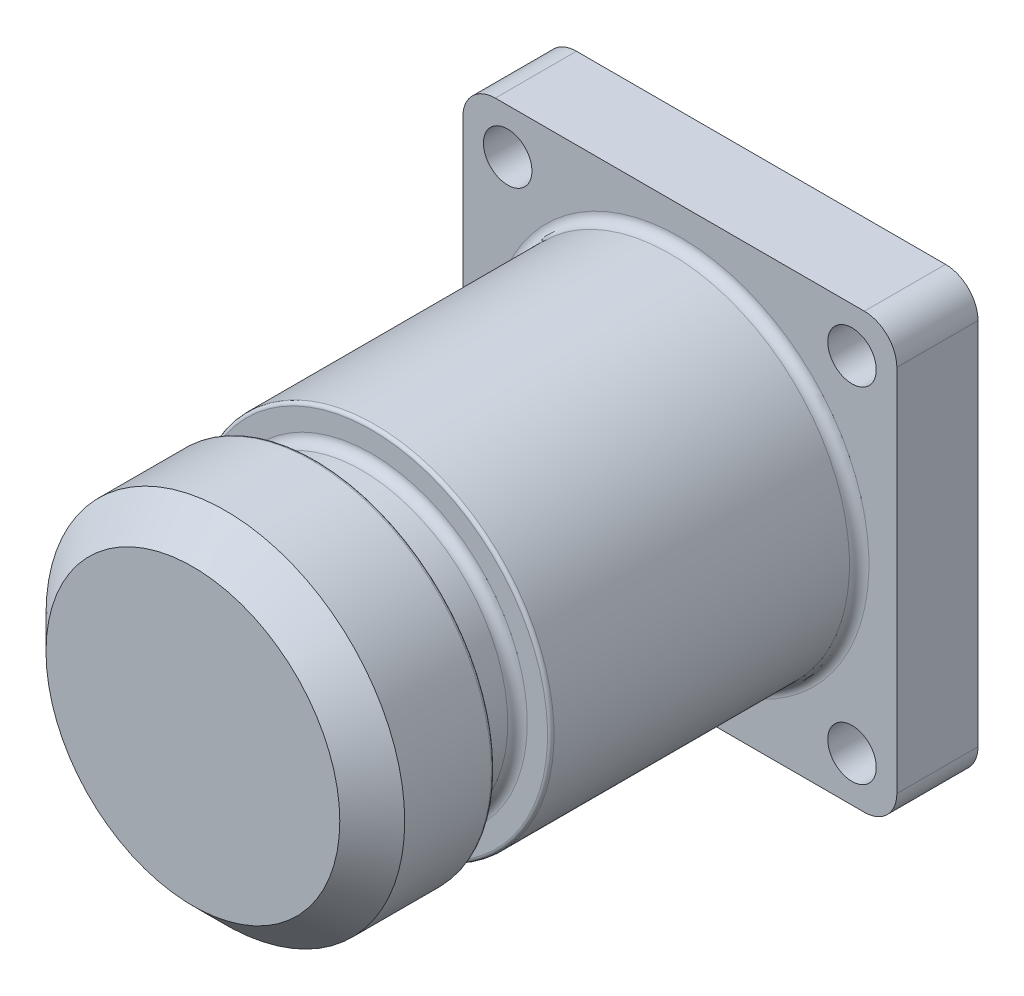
ISO-10303-21;
HEADER;
FILE_DESCRIPTION(('STEP AP214'),'2;1');
FILE_NAME('part.step','',(''),(''),'','','');
FILE_SCHEMA(('AUTOMOTIVE_DESIGN { 1 0 10303 214 1 1 1 1 }'));
ENDSEC;
DATA;
#1=APPLICATION_CONTEXT('core data for automotive mechanical design processes');
#2=APPLICATION_PROTOCOL_DEFINITION('international standard','automotive_design',2000,#1);
#3=PRODUCT_CONTEXT('',#1,'mechanical');
#4=PRODUCT('Part','Part','',(#3));
#5=PRODUCT_RELATED_PRODUCT_CATEGORY('part','',(#4));
#6=PRODUCT_DEFINITION_FORMATION('','',#4);
#7=PRODUCT_DEFINITION_CONTEXT('part definition',#1,'design');
#8=PRODUCT_DEFINITION('design','',#6,#7);
#9=PRODUCT_DEFINITION_SHAPE('','',#8);
#10=(LENGTH_UNIT() NAMED_UNIT(*) SI_UNIT(.MILLI.,.METRE.));
#11=(NAMED_UNIT(*) PLANE_ANGLE_UNIT() SI_UNIT($,.RADIAN.));
#12=(NAMED_UNIT(*) SI_UNIT($,.STERADIAN.) SOLID_ANGLE_UNIT());
#13=UNCERTAINTY_MEASURE_WITH_UNIT(LENGTH_MEASURE(1.E-05),#10,'distance_accuracy_value','');
#14=(GEOMETRIC_REPRESENTATION_CONTEXT(3) GLOBAL_UNCERTAINTY_ASSIGNED_CONTEXT((#13)) GLOBAL_UNIT_ASSIGNED_CONTEXT((#10,
#11,#12)) REPRESENTATION_CONTEXT('',''));
#15=CARTESIAN_POINT('',(0.,0.,0.));
#16=DIRECTION('',(0.,0.,1.));
#17=DIRECTION('',(1.,0.,0.));
#18=AXIS2_PLACEMENT_3D('',#15,#16,#17);
#19=CARTESIAN_POINT('',(0.,14.0335,38.1));
#20=DIRECTION('',(0.,0.,-1.));
#21=DIRECTION('',(-1.,0.,0.));
#22=AXIS2_PLACEMENT_3D('',#19,#20,#21);
#23=PLANE('',#22);
#24=CARTESIAN_POINT('',(0.,0.,38.1));
#25=DIRECTION('',(0.,0.,-1.));
#26=DIRECTION('',(-1.,0.,0.));
#27=AXIS2_PLACEMENT_3D('',#24,#25,#26);
#28=CIRCLE('',#27,11.4935);
#29=CARTESIAN_POINT('',(-11.4935,0.,38.1));
#30=VERTEX_POINT('',#29);
#31=EDGE_CURVE('E189',#30,#30,#28,.F.);
#32=ORIENTED_EDGE('',*,*,#31,.T.);
#33=EDGE_LOOP('',(#32));
#34=FACE_BOUND('',#33,.T.);
#35=ADVANCED_FACE('F45',(#34),#23,.F.);
#36=CARTESIAN_POINT('',(0.,14.0335,0.));
#37=DIRECTION('',(0.,0.,-1.));
#38=DIRECTION('',(-1.,0.,0.));
#39=AXIS2_PLACEMENT_3D('',#36,#37,#38);
#40=PLANE('',#39);
#41=CARTESIAN_POINT('',(0.,0.,0.));
#42=DIRECTION('',(0.,0.,-1.));
#43=DIRECTION('',(-1.,0.,0.));
#44=AXIS2_PLACEMENT_3D('',#41,#42,#43);
#45=CIRCLE('',#44,14.7955);
#46=CARTESIAN_POINT('',(-14.7955,0.,0.));
#47=VERTEX_POINT('',#46);
#48=EDGE_CURVE('E11',#47,#47,#45,.T.);
#49=ORIENTED_EDGE('',*,*,#48,.T.);
#50=EDGE_LOOP('',(#49));
#51=FACE_BOUND('',#50,.T.);
#52=CARTESIAN_POINT('',(13.4703841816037,13.4703841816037,0.));
#53=DIRECTION('',(0.,0.,-1.));
#54=DIRECTION('',(-1.,0.,0.));
#55=AXIS2_PLACEMENT_3D('',#52,#53,#54);
#56=CIRCLE('',#55,1.89864999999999);
#57=CARTESIAN_POINT('',(11.5717341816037,13.4703841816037,0.));
#58=VERTEX_POINT('',#57);
#59=EDGE_CURVE('E544',#58,#58,#56,.T.);
#60=ORIENTED_EDGE('',*,*,#59,.T.);
#61=EDGE_LOOP('',(#60));
#62=FACE_BOUND('',#61,.T.);
#63=CARTESIAN_POINT('',(-13.4703841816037,13.4703841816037,0.));
#64=DIRECTION('',(0.,0.,-1.));
#65=DIRECTION('',(-1.,0.,0.));
#66=AXIS2_PLACEMENT_3D('',#63,#64,#65);
#67=CIRCLE('',#66,1.89864999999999);
#68=CARTESIAN_POINT('',(-15.3690341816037,13.4703841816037,0.));
#69=VERTEX_POINT('',#68);
#70=EDGE_CURVE('E536',#69,#69,#67,.T.);
#71=ORIENTED_EDGE('',*,*,#70,.T.);
#72=EDGE_LOOP('',(#71));
#73=FACE_BOUND('',#72,.T.);
#74=CARTESIAN_POINT('',(-13.4703841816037,-13.4703841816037,0.));
#75=DIRECTION('',(0.,0.,-1.));
#76=DIRECTION('',(-1.,0.,0.));
#77=AXIS2_PLACEMENT_3D('',#74,#75,#76);
#78=CIRCLE('',#77,1.89864999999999);
#79=CARTESIAN_POINT('',(-15.3690341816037,-13.4703841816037,0.));
#80=VERTEX_POINT('',#79);
#81=EDGE_CURVE('E150',#80,#80,#78,.T.);
#82=ORIENTED_EDGE('',*,*,#81,.T.);
#83=EDGE_LOOP('',(#82));
#84=FACE_BOUND('',#83,.T.);
#85=CARTESIAN_POINT('',(13.4703841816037,-13.4703841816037,0.));
#86=DIRECTION('',(0.,0.,-1.));
#87=DIRECTION('',(-1.,0.,0.));
#88=AXIS2_PLACEMENT_3D('',#85,#86,#87);
#89=CIRCLE('',#88,1.89864999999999);
#90=CARTESIAN_POINT('',(11.5717341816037,-13.4703841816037,0.));
#91=VERTEX_POINT('',#90);
#92=EDGE_CURVE('E515',#91,#91,#89,.T.);
#93=ORIENTED_EDGE('',*,*,#92,.T.);
#94=EDGE_LOOP('',(#93));
#95=FACE_BOUND('',#94,.T.);
#96=DIRECTION('',(-1.,0.,0.));
#97=VECTOR('',#96,1.);
#98=CARTESIAN_POINT('',(-16.9785031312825,16.9785031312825,0.));
#99=LINE('',#98,#97);
#100=CARTESIAN_POINT('',(14.4385031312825,16.9785031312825,0.));
#101=VERTEX_POINT('',#100);
#102=CARTESIAN_POINT('',(-14.4385031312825,16.9785031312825,0.));
#103=VERTEX_POINT('',#102);
#104=EDGE_CURVE('E116',#101,#103,#99,.T.);
#105=ORIENTED_EDGE('',*,*,#104,.T.);
#106=CARTESIAN_POINT('',(-14.4385031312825,14.4385031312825,0.));
#107=DIRECTION('',(0.,0.,-1.));
#108=DIRECTION('',(-1.,0.,0.));
#109=AXIS2_PLACEMENT_3D('',#106,#107,#108);
#110=CIRCLE('',#109,2.54);
#111=CARTESIAN_POINT('',(-16.9785031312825,14.4385031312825,0.));
#112=VERTEX_POINT('',#111);
#113=EDGE_CURVE('E157',#103,#112,#110,.F.);
#114=ORIENTED_EDGE('',*,*,#113,.T.);
#115=DIRECTION('',(0.,-1.,0.));
#116=VECTOR('',#115,1.);
#117=CARTESIAN_POINT('',(-16.9785031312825,16.9785031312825,0.));
#118=LINE('',#117,#116);
#119=CARTESIAN_POINT('',(-16.9785031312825,-14.4385031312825,0.));
#120=VERTEX_POINT('',#119);
#121=EDGE_CURVE('E511',#112,#120,#118,.T.);
#122=ORIENTED_EDGE('',*,*,#121,.T.);
#123=CARTESIAN_POINT('',(-14.4385031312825,-14.4385031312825,0.));
#124=DIRECTION('',(0.,0.,-1.));
#125=DIRECTION('',(-1.,0.,0.));
#126=AXIS2_PLACEMENT_3D('',#123,#124,#125);
#127=CIRCLE('',#126,2.54);
#128=CARTESIAN_POINT('',(-14.4385031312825,-16.9785031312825,0.));
#129=VERTEX_POINT('',#128);
#130=EDGE_CURVE('E154',#120,#129,#127,.F.);
#131=ORIENTED_EDGE('',*,*,#130,.T.);
#132=DIRECTION('',(1.,0.,0.));
#133=VECTOR('',#132,1.);
#134=CARTESIAN_POINT('',(-16.9785031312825,-16.9785031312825,0.));
#135=LINE('',#134,#133);
#136=CARTESIAN_POINT('',(14.4385031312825,-16.9785031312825,0.));
#137=VERTEX_POINT('',#136);
#138=EDGE_CURVE('E504',#129,#137,#135,.T.);
#139=ORIENTED_EDGE('',*,*,#138,.T.);
#140=CARTESIAN_POINT('',(14.4385031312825,-14.4385031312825,0.));
#141=DIRECTION('',(0.,0.,-1.));
#142=DIRECTION('',(-1.,0.,0.));
#143=AXIS2_PLACEMENT_3D('',#140,#141,#142);
#144=CIRCLE('',#143,2.54);
#145=CARTESIAN_POINT('',(16.9785031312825,-14.4385031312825,0.));
#146=VERTEX_POINT('',#145);
#147=EDGE_CURVE('E124',#137,#146,#144,.F.);
#148=ORIENTED_EDGE('',*,*,#147,.T.);
#149=DIRECTION('',(0.,1.,0.));
#150=VECTOR('',#149,1.);
#151=CARTESIAN_POINT('',(16.9785031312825,16.9785031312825,0.));
#152=LINE('',#151,#150);
#153=CARTESIAN_POINT('',(16.9785031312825,14.4385031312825,0.));
#154=VERTEX_POINT('',#153);
#155=EDGE_CURVE('E118',#146,#154,#152,.T.);
#156=ORIENTED_EDGE('',*,*,#155,.T.);
#157=CARTESIAN_POINT('',(14.4385031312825,14.4385031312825,0.));
#158=DIRECTION('',(0.,0.,-1.));
#159=DIRECTION('',(-1.,0.,0.));
#160=AXIS2_PLACEMENT_3D('',#157,#158,#159);
#161=CIRCLE('',#160,2.54);
#162=EDGE_CURVE('E113',#154,#101,#161,.F.);
#163=ORIENTED_EDGE('',*,*,#162,.T.);
#164=EDGE_LOOP('',(#105,#114,#122,#131,#139,#148,#156,#163));
#165=FACE_BOUND('',#164,.T.);
#166=ADVANCED_FACE('F115',(#51,#62,#73,#84,#95,#165),#40,.F.);
#167=CARTESIAN_POINT('',(0.,0.,0.145825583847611));
#168=DIRECTION('',(0.,0.,1.));
#169=DIRECTION('',(1.,0.,0.));
#170=AXIS2_PLACEMENT_3D('',#167,#168,#169);
#171=CYLINDRICAL_SURFACE('',#170,14.0335);
#172=CARTESIAN_POINT('',(0.,0.,0.762));
#173=DIRECTION('',(0.,0.,-1.));
#174=DIRECTION('',(-1.,0.,0.));
#175=AXIS2_PLACEMENT_3D('',#172,#173,#174);
#176=CIRCLE('',#175,14.0335);
#177=CARTESIAN_POINT('',(-14.0335,0.,0.762));
#178=VERTEX_POINT('',#177);
#179=EDGE_CURVE('E54',#178,#178,#176,.F.);
#180=ORIENTED_EDGE('',*,*,#179,.T.);
#181=EDGE_LOOP('',(#180));
#182=FACE_BOUND('',#181,.T.);
#183=CARTESIAN_POINT('',(0.,0.,23.876));
#184=DIRECTION('',(0.,0.,-1.));
#185=DIRECTION('',(-1.,0.,0.));
#186=AXIS2_PLACEMENT_3D('',#183,#184,#185);
#187=CIRCLE('',#186,14.0335);
#188=CARTESIAN_POINT('',(-14.0335,0.,23.876));
#189=VERTEX_POINT('',#188);
#190=EDGE_CURVE('E225',#189,#189,#187,.T.);
#191=ORIENTED_EDGE('',*,*,#190,.T.);
#192=EDGE_LOOP('',(#191));
#193=FACE_BOUND('',#192,.T.);
#194=ADVANCED_FACE('F233',(#182,#193),#171,.T.);
#195=CARTESIAN_POINT('',(0.,14.0335,24.13));
#196=DIRECTION('',(0.,0.,-1.));
#197=DIRECTION('',(-1.,0.,0.));
#198=AXIS2_PLACEMENT_3D('',#195,#196,#197);
#199=PLANE('',#198);
#200=CARTESIAN_POINT('',(0.,0.,24.13));
#201=DIRECTION('',(0.,0.,-1.));
#202=DIRECTION('',(-1.,0.,0.));
#203=AXIS2_PLACEMENT_3D('',#200,#201,#202);
#204=CIRCLE('',#203,13.7795);
#205=CARTESIAN_POINT('',(-13.7795,0.,24.13));
#206=VERTEX_POINT('',#205);
#207=EDGE_CURVE('E221',#206,#206,#204,.F.);
#208=ORIENTED_EDGE('',*,*,#207,.T.);
#209=EDGE_LOOP('',(#208));
#210=FACE_BOUND('',#209,.T.);
#211=CARTESIAN_POINT('',(0.,0.,24.13));
#212=DIRECTION('',(0.,0.,-1.));
#213=DIRECTION('',(-1.,0.,0.));
#214=AXIS2_PLACEMENT_3D('',#211,#212,#213);
#215=CIRCLE('',#214,12.192);
#216=CARTESIAN_POINT('',(-12.192,0.,24.13));
#217=VERTEX_POINT('',#216);
#218=EDGE_CURVE('E209',#217,#217,#215,.T.);
#219=ORIENTED_EDGE('',*,*,#218,.T.);
#220=EDGE_LOOP('',(#219));
#221=FACE_BOUND('',#220,.T.);
#222=ADVANCED_FACE('F317',(#210,#221),#199,.F.);
#223=CARTESIAN_POINT('',(0.,0.,0.145825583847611));
#224=DIRECTION('',(0.,0.,1.));
#225=DIRECTION('',(1.,0.,0.));
#226=AXIS2_PLACEMENT_3D('',#223,#224,#225);
#227=CYLINDRICAL_SURFACE('',#226,11.43);
#228=CARTESIAN_POINT('',(0.,0.,27.7622));
#229=DIRECTION('',(0.,0.,1.));
#230=DIRECTION('',(1.,0.,0.));
#231=AXIS2_PLACEMENT_3D('',#228,#229,#230);
#232=CIRCLE('',#231,11.43);
#233=CARTESIAN_POINT('',(11.43,0.,27.7622));
#234=VERTEX_POINT('',#233);
#235=EDGE_CURVE('E205',#234,#234,#232,.F.);
#236=ORIENTED_EDGE('',*,*,#235,.T.);
#237=EDGE_LOOP('',(#236));
#238=FACE_BOUND('',#237,.T.);
#239=CARTESIAN_POINT('',(0.,0.,24.892));
#240=DIRECTION('',(0.,0.,-1.));
#241=DIRECTION('',(-1.,0.,0.));
#242=AXIS2_PLACEMENT_3D('',#239,#240,#241);
#243=CIRCLE('',#242,11.43);
#244=CARTESIAN_POINT('',(-11.43,0.,24.892));
#245=VERTEX_POINT('',#244);
#246=EDGE_CURVE('E201',#245,#245,#243,.F.);
#247=ORIENTED_EDGE('',*,*,#246,.T.);
#248=EDGE_LOOP('',(#247));
#249=FACE_BOUND('',#248,.T.);
#250=ADVANCED_FACE('F310',(#238,#249),#227,.T.);
#251=CARTESIAN_POINT('',(0.,14.0335,28.5242));
#252=DIRECTION('',(0.,0.,1.));
#253=DIRECTION('',(1.,0.,0.));
#254=AXIS2_PLACEMENT_3D('',#251,#252,#253);
#255=PLANE('',#254);
#256=CARTESIAN_POINT('',(0.,0.,28.5242));
#257=DIRECTION('',(0.,0.,1.));
#258=DIRECTION('',(1.,0.,0.));
#259=AXIS2_PLACEMENT_3D('',#256,#257,#258);
#260=CIRCLE('',#259,13.7795);
#261=CARTESIAN_POINT('',(13.7795,0.,28.5242));
#262=VERTEX_POINT('',#261);
#263=EDGE_CURVE('E217',#262,#262,#260,.F.);
#264=ORIENTED_EDGE('',*,*,#263,.T.);
#265=EDGE_LOOP('',(#264));
#266=FACE_BOUND('',#265,.T.);
#267=CARTESIAN_POINT('',(0.,0.,28.5242));
#268=DIRECTION('',(0.,0.,1.));
#269=DIRECTION('',(1.,0.,0.));
#270=AXIS2_PLACEMENT_3D('',#267,#268,#269);
#271=CIRCLE('',#270,12.192);
#272=CARTESIAN_POINT('',(12.192,0.,28.5242));
#273=VERTEX_POINT('',#272);
#274=EDGE_CURVE('E197',#273,#273,#271,.T.);
#275=ORIENTED_EDGE('',*,*,#274,.T.);
#276=EDGE_LOOP('',(#275));
#277=FACE_BOUND('',#276,.T.);
#278=ADVANCED_FACE('F299',(#266,#277),#255,.F.);
#279=CARTESIAN_POINT('',(0.,0.,0.145825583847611));
#280=DIRECTION('',(0.,0.,1.));
#281=DIRECTION('',(1.,0.,0.));
#282=AXIS2_PLACEMENT_3D('',#279,#280,#281);
#283=CYLINDRICAL_SURFACE('',#282,14.0335);
#284=CARTESIAN_POINT('',(0.,0.,28.7782));
#285=DIRECTION('',(0.,0.,1.));
#286=DIRECTION('',(1.,0.,0.));
#287=AXIS2_PLACEMENT_3D('',#284,#285,#286);
#288=CIRCLE('',#287,14.0335);
#289=CARTESIAN_POINT('',(14.0335,0.,28.7782));
#290=VERTEX_POINT('',#289);
#291=EDGE_CURVE('E213',#290,#290,#288,.T.);
#292=ORIENTED_EDGE('',*,*,#291,.T.);
#293=EDGE_LOOP('',(#292));
#294=FACE_BOUND('',#293,.T.);
#295=CARTESIAN_POINT('',(0.,0.,35.56));
#296=DIRECTION('',(0.,0.,-1.));
#297=DIRECTION('',(-1.,0.,0.));
#298=AXIS2_PLACEMENT_3D('',#295,#296,#297);
#299=CIRCLE('',#298,14.0335);
#300=CARTESIAN_POINT('',(-14.0335,0.,35.56));
#301=VERTEX_POINT('',#300);
#302=EDGE_CURVE('E193',#301,#301,#299,.T.);
#303=ORIENTED_EDGE('',*,*,#302,.T.);
#304=EDGE_LOOP('',(#303));
#305=FACE_BOUND('',#304,.T.);
#306=ADVANCED_FACE('F296',(#294,#305),#283,.T.);
#307=CARTESIAN_POINT('',(-16.9785031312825,16.9785031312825,-6.35));
#308=DIRECTION('',(-1.,0.,0.));
#309=DIRECTION('',(0.,0.,1.));
#310=AXIS2_PLACEMENT_3D('',#307,#308,#309);
#311=PLANE('',#310);
#312=ORIENTED_EDGE('',*,*,#121,.F.);
#313=DIRECTION('',(0.,0.,1.));
#314=VECTOR('',#313,1.);
#315=CARTESIAN_POINT('',(-16.9785031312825,14.4385031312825,-6.35));
#316=LINE('',#315,#314);
#317=CARTESIAN_POINT('',(-16.9785031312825,14.4385031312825,-6.35));
#318=VERTEX_POINT('',#317);
#319=EDGE_CURVE('E164',#112,#318,#316,.F.);
#320=ORIENTED_EDGE('',*,*,#319,.T.);
#321=DIRECTION('',(0.,-1.,0.));
#322=VECTOR('',#321,1.);
#323=CARTESIAN_POINT('',(-16.9785031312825,16.9785031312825,-6.35));
#324=LINE('',#323,#322);
#325=CARTESIAN_POINT('',(-16.9785031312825,-14.4385031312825,-6.35));
#326=VERTEX_POINT('',#325);
#327=EDGE_CURVE('E135',#318,#326,#324,.T.);
#328=ORIENTED_EDGE('',*,*,#327,.T.);
#329=DIRECTION('',(0.,0.,1.));
#330=VECTOR('',#329,1.);
#331=CARTESIAN_POINT('',(-16.9785031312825,-14.4385031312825,-6.35));
#332=LINE('',#331,#330);
#333=EDGE_CURVE('E160',#326,#120,#332,.T.);
#334=ORIENTED_EDGE('',*,*,#333,.T.);
#335=EDGE_LOOP('',(#312,#320,#328,#334));
#336=FACE_BOUND('',#335,.T.);
#337=ADVANCED_FACE('F298',(#336),#311,.T.);
#338=CARTESIAN_POINT('',(-16.9785031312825,16.9785031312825,-6.35));
#339=DIRECTION('',(0.,1.,0.));
#340=DIRECTION('',(0.,0.,1.));
#341=AXIS2_PLACEMENT_3D('',#338,#339,#340);
#342=PLANE('',#341);
#343=DIRECTION('',(-1.,0.,0.));
#344=VECTOR('',#343,1.);
#345=CARTESIAN_POINT('',(-16.9785031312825,16.9785031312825,-6.35));
#346=LINE('',#345,#344);
#347=CARTESIAN_POINT('',(14.4385031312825,16.9785031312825,-6.35));
#348=VERTEX_POINT('',#347);
#349=CARTESIAN_POINT('',(-14.4385031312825,16.9785031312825,-6.35));
#350=VERTEX_POINT('',#349);
#351=EDGE_CURVE('E141',#348,#350,#346,.T.);
#352=ORIENTED_EDGE('',*,*,#351,.T.);
#353=DIRECTION('',(0.,0.,1.));
#354=VECTOR('',#353,1.);
#355=CARTESIAN_POINT('',(-14.4385031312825,16.9785031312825,-6.35));
#356=LINE('',#355,#354);
#357=EDGE_CURVE('E125',#350,#103,#356,.T.);
#358=ORIENTED_EDGE('',*,*,#357,.T.);
#359=ORIENTED_EDGE('',*,*,#104,.F.);
#360=DIRECTION('',(0.,0.,1.));
#361=VECTOR('',#360,1.);
#362=CARTESIAN_POINT('',(14.4385031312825,16.9785031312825,-6.35));
#363=LINE('',#362,#361);
#364=EDGE_CURVE('E131',#101,#348,#363,.F.);
#365=ORIENTED_EDGE('',*,*,#364,.T.);
#366=EDGE_LOOP('',(#352,#358,#359,#365));
#367=FACE_BOUND('',#366,.T.);
#368=ADVANCED_FACE('F130',(#367),#342,.T.);
#369=CARTESIAN_POINT('',(16.9785031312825,16.9785031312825,-6.35));
#370=DIRECTION('',(1.,0.,0.));
#371=DIRECTION('',(0.,0.,-1.));
#372=AXIS2_PLACEMENT_3D('',#369,#370,#371);
#373=PLANE('',#372);
#374=ORIENTED_EDGE('',*,*,#155,.F.);
#375=DIRECTION('',(0.,0.,1.));
#376=VECTOR('',#375,1.);
#377=CARTESIAN_POINT('',(16.9785031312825,-14.4385031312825,-6.35));
#378=LINE('',#377,#376);
#379=CARTESIAN_POINT('',(16.9785031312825,-14.4385031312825,-6.35));
#380=VERTEX_POINT('',#379);
#381=EDGE_CURVE('E186',#146,#380,#378,.F.);
#382=ORIENTED_EDGE('',*,*,#381,.T.);
#383=DIRECTION('',(0.,1.,0.));
#384=VECTOR('',#383,1.);
#385=CARTESIAN_POINT('',(16.9785031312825,16.9785031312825,-6.35));
#386=LINE('',#385,#384);
#387=CARTESIAN_POINT('',(16.9785031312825,14.4385031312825,-6.35));
#388=VERTEX_POINT('',#387);
#389=EDGE_CURVE('E147',#380,#388,#386,.T.);
#390=ORIENTED_EDGE('',*,*,#389,.T.);
#391=DIRECTION('',(0.,0.,1.));
#392=VECTOR('',#391,1.);
#393=CARTESIAN_POINT('',(16.9785031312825,14.4385031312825,-6.35));
#394=LINE('',#393,#392);
#395=EDGE_CURVE('E183',#388,#154,#394,.T.);
#396=ORIENTED_EDGE('',*,*,#395,.T.);
#397=EDGE_LOOP('',(#374,#382,#390,#396));
#398=FACE_BOUND('',#397,.T.);
#399=ADVANCED_FACE('F446',(#398),#373,.T.);
#400=CARTESIAN_POINT('',(-16.9785031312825,-16.9785031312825,-6.35));
#401=DIRECTION('',(0.,-1.,0.));
#402=DIRECTION('',(0.,0.,-1.));
#403=AXIS2_PLACEMENT_3D('',#400,#401,#402);
#404=PLANE('',#403);
#405=ORIENTED_EDGE('',*,*,#138,.F.);
#406=DIRECTION('',(0.,0.,1.));
#407=VECTOR('',#406,1.);
#408=CARTESIAN_POINT('',(-14.4385031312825,-16.9785031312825,-6.35));
#409=LINE('',#408,#407);
#410=CARTESIAN_POINT('',(-14.4385031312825,-16.9785031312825,-6.35));
#411=VERTEX_POINT('',#410);
#412=EDGE_CURVE('E68',#129,#411,#409,.F.);
#413=ORIENTED_EDGE('',*,*,#412,.T.);
#414=DIRECTION('',(1.,0.,0.));
#415=VECTOR('',#414,1.);
#416=CARTESIAN_POINT('',(-16.9785031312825,-16.9785031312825,-6.35));
#417=LINE('',#416,#415);
#418=CARTESIAN_POINT('',(14.4385031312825,-16.9785031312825,-6.35));
#419=VERTEX_POINT('',#418);
#420=EDGE_CURVE('E508',#411,#419,#417,.T.);
#421=ORIENTED_EDGE('',*,*,#420,.T.);
#422=DIRECTION('',(0.,0.,1.));
#423=VECTOR('',#422,1.);
#424=CARTESIAN_POINT('',(14.4385031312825,-16.9785031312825,-6.35));
#425=LINE('',#424,#423);
#426=EDGE_CURVE('E177',#419,#137,#425,.T.);
#427=ORIENTED_EDGE('',*,*,#426,.T.);
#428=EDGE_LOOP('',(#405,#413,#421,#427));
#429=FACE_BOUND('',#428,.T.);
#430=ADVANCED_FACE('F436',(#429),#404,.T.);
#431=CARTESIAN_POINT('',(0.,16.9785031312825,-6.35));
#432=DIRECTION('',(0.,0.,1.));
#433=DIRECTION('',(1.,0.,0.));
#434=AXIS2_PLACEMENT_3D('',#431,#432,#433);
#435=PLANE('',#434);
#436=CARTESIAN_POINT('',(13.4703841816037,13.4703841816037,-6.35));
#437=DIRECTION('',(0.,0.,-1.));
#438=DIRECTION('',(-1.,0.,0.));
#439=AXIS2_PLACEMENT_3D('',#436,#437,#438);
#440=CIRCLE('',#439,1.89864999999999);
#441=CARTESIAN_POINT('',(11.5717341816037,13.4703841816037,-6.35));
#442=VERTEX_POINT('',#441);
#443=EDGE_CURVE('E548',#442,#442,#440,.T.);
#444=ORIENTED_EDGE('',*,*,#443,.F.);
#445=EDGE_LOOP('',(#444));
#446=FACE_BOUND('',#445,.T.);
#447=CARTESIAN_POINT('',(-13.4703841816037,13.4703841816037,-6.35));
#448=DIRECTION('',(0.,0.,-1.));
#449=DIRECTION('',(-1.,0.,0.));
#450=AXIS2_PLACEMENT_3D('',#447,#448,#449);
#451=CIRCLE('',#450,1.89864999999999);
#452=CARTESIAN_POINT('',(-15.3690341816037,13.4703841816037,-6.35));
#453=VERTEX_POINT('',#452);
#454=EDGE_CURVE('E540',#453,#453,#451,.T.);
#455=ORIENTED_EDGE('',*,*,#454,.F.);
#456=EDGE_LOOP('',(#455));
#457=FACE_BOUND('',#456,.T.);
#458=CARTESIAN_POINT('',(-13.4703841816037,-13.4703841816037,-6.35));
#459=DIRECTION('',(0.,0.,-1.));
#460=DIRECTION('',(-1.,0.,0.));
#461=AXIS2_PLACEMENT_3D('',#458,#459,#460);
#462=CIRCLE('',#461,1.89864999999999);
#463=CARTESIAN_POINT('',(-15.3690341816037,-13.4703841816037,-6.35));
#464=VERTEX_POINT('',#463);
#465=EDGE_CURVE('E532',#464,#464,#462,.T.);
#466=ORIENTED_EDGE('',*,*,#465,.F.);
#467=EDGE_LOOP('',(#466));
#468=FACE_BOUND('',#467,.T.);
#469=CARTESIAN_POINT('',(13.4703841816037,-13.4703841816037,-6.35));
#470=DIRECTION('',(0.,0.,-1.));
#471=DIRECTION('',(-1.,0.,0.));
#472=AXIS2_PLACEMENT_3D('',#469,#470,#471);
#473=CIRCLE('',#472,1.89864999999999);
#474=CARTESIAN_POINT('',(11.5717341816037,-13.4703841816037,-6.35));
#475=VERTEX_POINT('',#474);
#476=EDGE_CURVE('E528',#475,#475,#473,.T.);
#477=ORIENTED_EDGE('',*,*,#476,.F.);
#478=EDGE_LOOP('',(#477));
#479=FACE_BOUND('',#478,.T.);
#480=ORIENTED_EDGE('',*,*,#327,.F.);
#481=CARTESIAN_POINT('',(-14.4385031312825,14.4385031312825,-6.35));
#482=DIRECTION('',(0.,0.,1.));
#483=DIRECTION('',(1.,0.,0.));
#484=AXIS2_PLACEMENT_3D('',#481,#482,#483);
#485=CIRCLE('',#484,2.54);
#486=EDGE_CURVE('E174',#318,#350,#485,.F.);
#487=ORIENTED_EDGE('',*,*,#486,.T.);
#488=ORIENTED_EDGE('',*,*,#351,.F.);
#489=CARTESIAN_POINT('',(14.4385031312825,14.4385031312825,-6.35));
#490=DIRECTION('',(0.,0.,1.));
#491=DIRECTION('',(1.,0.,0.));
#492=AXIS2_PLACEMENT_3D('',#489,#490,#491);
#493=CIRCLE('',#492,2.54);
#494=EDGE_CURVE('E139',#348,#388,#493,.F.);
#495=ORIENTED_EDGE('',*,*,#494,.T.);
#496=ORIENTED_EDGE('',*,*,#389,.F.);
#497=CARTESIAN_POINT('',(14.4385031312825,-14.4385031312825,-6.35));
#498=DIRECTION('',(0.,0.,1.));
#499=DIRECTION('',(1.,0.,0.));
#500=AXIS2_PLACEMENT_3D('',#497,#498,#499);
#501=CIRCLE('',#500,2.54);
#502=EDGE_CURVE('E61',#380,#419,#501,.F.);
#503=ORIENTED_EDGE('',*,*,#502,.T.);
#504=ORIENTED_EDGE('',*,*,#420,.F.);
#505=CARTESIAN_POINT('',(-14.4385031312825,-14.4385031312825,-6.35));
#506=DIRECTION('',(0.,0.,1.));
#507=DIRECTION('',(1.,0.,0.));
#508=AXIS2_PLACEMENT_3D('',#505,#506,#507);
#509=CIRCLE('',#508,2.54);
#510=EDGE_CURVE('E171',#411,#326,#509,.F.);
#511=ORIENTED_EDGE('',*,*,#510,.T.);
#512=EDGE_LOOP('',(#480,#487,#488,#495,#496,#503,#504,#511));
#513=FACE_BOUND('',#512,.T.);
#514=ADVANCED_FACE('F258',(#446,#457,#468,#479,#513),#435,.F.);
#515=CARTESIAN_POINT('',(13.4703841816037,-13.4703841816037,-6.35));
#516=DIRECTION('',(0.,0.,-1.));
#517=DIRECTION('',(-1.,0.,0.));
#518=AXIS2_PLACEMENT_3D('',#515,#516,#517);
#519=CYLINDRICAL_SURFACE('',#518,1.89864999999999);
#520=ORIENTED_EDGE('',*,*,#476,.T.);
#521=EDGE_LOOP('',(#520));
#522=FACE_BOUND('',#521,.T.);
#523=ORIENTED_EDGE('',*,*,#92,.F.);
#524=EDGE_LOOP('',(#523));
#525=FACE_BOUND('',#524,.T.);
#526=ADVANCED_FACE('F417',(#522,#525),#519,.F.);
#527=CARTESIAN_POINT('',(-13.4703841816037,-13.4703841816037,-6.35));
#528=DIRECTION('',(0.,0.,-1.));
#529=DIRECTION('',(-1.,0.,0.));
#530=AXIS2_PLACEMENT_3D('',#527,#528,#529);
#531=CYLINDRICAL_SURFACE('',#530,1.89864999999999);
#532=ORIENTED_EDGE('',*,*,#465,.T.);
#533=EDGE_LOOP('',(#532));
#534=FACE_BOUND('',#533,.T.);
#535=ORIENTED_EDGE('',*,*,#81,.F.);
#536=EDGE_LOOP('',(#535));
#537=FACE_BOUND('',#536,.T.);
#538=ADVANCED_FACE('F407',(#534,#537),#531,.F.);
#539=CARTESIAN_POINT('',(-13.4703841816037,13.4703841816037,-6.35));
#540=DIRECTION('',(0.,0.,-1.));
#541=DIRECTION('',(-1.,0.,0.));
#542=AXIS2_PLACEMENT_3D('',#539,#540,#541);
#543=CYLINDRICAL_SURFACE('',#542,1.89864999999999);
#544=ORIENTED_EDGE('',*,*,#454,.T.);
#545=EDGE_LOOP('',(#544));
#546=FACE_BOUND('',#545,.T.);
#547=ORIENTED_EDGE('',*,*,#70,.F.);
#548=EDGE_LOOP('',(#547));
#549=FACE_BOUND('',#548,.T.);
#550=ADVANCED_FACE('F397',(#546,#549),#543,.F.);
#551=CARTESIAN_POINT('',(13.4703841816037,13.4703841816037,-6.35));
#552=DIRECTION('',(0.,0.,-1.));
#553=DIRECTION('',(-1.,0.,0.));
#554=AXIS2_PLACEMENT_3D('',#551,#552,#553);
#555=CYLINDRICAL_SURFACE('',#554,1.89864999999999);
#556=ORIENTED_EDGE('',*,*,#443,.T.);
#557=EDGE_LOOP('',(#556));
#558=FACE_BOUND('',#557,.T.);
#559=ORIENTED_EDGE('',*,*,#59,.F.);
#560=EDGE_LOOP('',(#559));
#561=FACE_BOUND('',#560,.T.);
#562=ADVANCED_FACE('F263',(#558,#561),#555,.F.);
#563=CARTESIAN_POINT('',(-14.4385031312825,14.4385031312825,-6.35));
#564=DIRECTION('',(0.,0.,1.));
#565=DIRECTION('',(1.,0.,0.));
#566=AXIS2_PLACEMENT_3D('',#563,#564,#565);
#567=CYLINDRICAL_SURFACE('',#566,2.54);
#568=ORIENTED_EDGE('',*,*,#486,.F.);
#569=ORIENTED_EDGE('',*,*,#319,.F.);
#570=ORIENTED_EDGE('',*,*,#113,.F.);
#571=ORIENTED_EDGE('',*,*,#357,.F.);
#572=EDGE_LOOP('',(#568,#569,#570,#571));
#573=FACE_BOUND('',#572,.T.);
#574=ADVANCED_FACE('F259',(#573),#567,.T.);
#575=CARTESIAN_POINT('',(-14.4385031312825,-14.4385031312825,-6.35));
#576=DIRECTION('',(0.,0.,1.));
#577=DIRECTION('',(1.,0.,0.));
#578=AXIS2_PLACEMENT_3D('',#575,#576,#577);
#579=CYLINDRICAL_SURFACE('',#578,2.54);
#580=ORIENTED_EDGE('',*,*,#510,.F.);
#581=ORIENTED_EDGE('',*,*,#412,.F.);
#582=ORIENTED_EDGE('',*,*,#130,.F.);
#583=ORIENTED_EDGE('',*,*,#333,.F.);
#584=EDGE_LOOP('',(#580,#581,#582,#583));
#585=FACE_BOUND('',#584,.T.);
#586=ADVANCED_FACE('F262',(#585),#579,.T.);
#587=CARTESIAN_POINT('',(14.4385031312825,-14.4385031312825,-6.35));
#588=DIRECTION('',(0.,0.,1.));
#589=DIRECTION('',(1.,0.,0.));
#590=AXIS2_PLACEMENT_3D('',#587,#588,#589);
#591=CYLINDRICAL_SURFACE('',#590,2.54);
#592=ORIENTED_EDGE('',*,*,#502,.F.);
#593=ORIENTED_EDGE('',*,*,#381,.F.);
#594=ORIENTED_EDGE('',*,*,#147,.F.);
#595=ORIENTED_EDGE('',*,*,#426,.F.);
#596=EDGE_LOOP('',(#592,#593,#594,#595));
#597=FACE_BOUND('',#596,.T.);
#598=ADVANCED_FACE('F267',(#597),#591,.T.);
#599=CARTESIAN_POINT('',(14.4385031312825,14.4385031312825,-6.35));
#600=DIRECTION('',(0.,0.,1.));
#601=DIRECTION('',(1.,0.,0.));
#602=AXIS2_PLACEMENT_3D('',#599,#600,#601);
#603=CYLINDRICAL_SURFACE('',#602,2.54);
#604=ORIENTED_EDGE('',*,*,#494,.F.);
#605=ORIENTED_EDGE('',*,*,#364,.F.);
#606=ORIENTED_EDGE('',*,*,#162,.F.);
#607=ORIENTED_EDGE('',*,*,#395,.F.);
#608=EDGE_LOOP('',(#604,#605,#606,#607));
#609=FACE_BOUND('',#608,.T.);
#610=ADVANCED_FACE('F138',(#609),#603,.T.);
#611=CARTESIAN_POINT('',(0.,0.,38.1));
#612=DIRECTION('',(0.,0.,-1.));
#613=DIRECTION('',(-1.,0.,0.));
#614=AXIS2_PLACEMENT_3D('',#611,#612,#613);
#615=CONICAL_SURFACE('',#614,11.4935,0.785398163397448);
#616=ORIENTED_EDGE('',*,*,#302,.F.);
#617=EDGE_LOOP('',(#616));
#618=FACE_BOUND('',#617,.T.);
#619=ORIENTED_EDGE('',*,*,#31,.F.);
#620=EDGE_LOOP('',(#619));
#621=FACE_BOUND('',#620,.T.);
#622=ADVANCED_FACE('F273',(#618,#621),#615,.T.);
#623=CARTESIAN_POINT('',(0.,0.,27.7622));
#624=DIRECTION('',(0.,0.,1.));
#625=DIRECTION('',(1.,0.,0.));
#626=AXIS2_PLACEMENT_3D('',#623,#624,#625);
#627=TOROIDAL_SURFACE('',#626,12.192,0.762);
#628=ORIENTED_EDGE('',*,*,#235,.F.);
#629=EDGE_LOOP('',(#628));
#630=FACE_BOUND('',#629,.T.);
#631=ORIENTED_EDGE('',*,*,#274,.F.);
#632=EDGE_LOOP('',(#631));
#633=FACE_BOUND('',#632,.T.);
#634=ADVANCED_FACE('F278',(#630,#633),#627,.F.);
#635=CARTESIAN_POINT('',(0.,0.,24.892));
#636=DIRECTION('',(0.,0.,-1.));
#637=DIRECTION('',(-1.,0.,0.));
#638=AXIS2_PLACEMENT_3D('',#635,#636,#637);
#639=TOROIDAL_SURFACE('',#638,12.192,0.762);
#640=ORIENTED_EDGE('',*,*,#218,.F.);
#641=EDGE_LOOP('',(#640));
#642=FACE_BOUND('',#641,.T.);
#643=ORIENTED_EDGE('',*,*,#246,.F.);
#644=EDGE_LOOP('',(#643));
#645=FACE_BOUND('',#644,.T.);
#646=ADVANCED_FACE('F282',(#642,#645),#639,.F.);
#647=CARTESIAN_POINT('',(0.,0.,28.7782));
#648=DIRECTION('',(0.,0.,1.));
#649=DIRECTION('',(1.,0.,0.));
#650=AXIS2_PLACEMENT_3D('',#647,#648,#649);
#651=TOROIDAL_SURFACE('',#650,13.7795,0.254);
#652=ORIENTED_EDGE('',*,*,#263,.F.);
#653=EDGE_LOOP('',(#652));
#654=FACE_BOUND('',#653,.T.);
#655=ORIENTED_EDGE('',*,*,#291,.F.);
#656=EDGE_LOOP('',(#655));
#657=FACE_BOUND('',#656,.T.);
#658=ADVANCED_FACE('F243',(#654,#657),#651,.T.);
#659=CARTESIAN_POINT('',(0.,0.,23.876));
#660=DIRECTION('',(0.,0.,-1.));
#661=DIRECTION('',(-1.,0.,0.));
#662=AXIS2_PLACEMENT_3D('',#659,#660,#661);
#663=TOROIDAL_SURFACE('',#662,13.7795,0.254);
#664=ORIENTED_EDGE('',*,*,#190,.F.);
#665=EDGE_LOOP('',(#664));
#666=FACE_BOUND('',#665,.T.);
#667=ORIENTED_EDGE('',*,*,#207,.F.);
#668=EDGE_LOOP('',(#667));
#669=FACE_BOUND('',#668,.T.);
#670=ADVANCED_FACE('F237',(#666,#669),#663,.T.);
#671=CARTESIAN_POINT('',(0.,0.,0.762));
#672=DIRECTION('',(0.,0.,-1.));
#673=DIRECTION('',(-1.,0.,0.));
#674=AXIS2_PLACEMENT_3D('',#671,#672,#673);
#675=TOROIDAL_SURFACE('',#674,14.7955,0.762);
#676=ORIENTED_EDGE('',*,*,#48,.F.);
#677=EDGE_LOOP('',(#676));
#678=FACE_BOUND('',#677,.T.);
#679=ORIENTED_EDGE('',*,*,#179,.F.);
#680=EDGE_LOOP('',(#679));
#681=FACE_BOUND('',#680,.T.);
#682=ADVANCED_FACE('F47',(#678,#681),#675,.F.);
#683=CLOSED_SHELL('',(#35,#166,#194,#222,#250,#278,#306,#337,#368,#399,#430,#514,#526,#538,#550,
#562,#574,#586,#598,#610,#622,#634,#646,#658,#670,#682));
#684=MANIFOLD_SOLID_BREP('B2',#683);
#685=ADVANCED_BREP_SHAPE_REPRESENTATION('',(#18,#684),#14);
#686=SHAPE_DEFINITION_REPRESENTATION(#9,#685);
ENDSEC;
END-ISO-10303-21;
